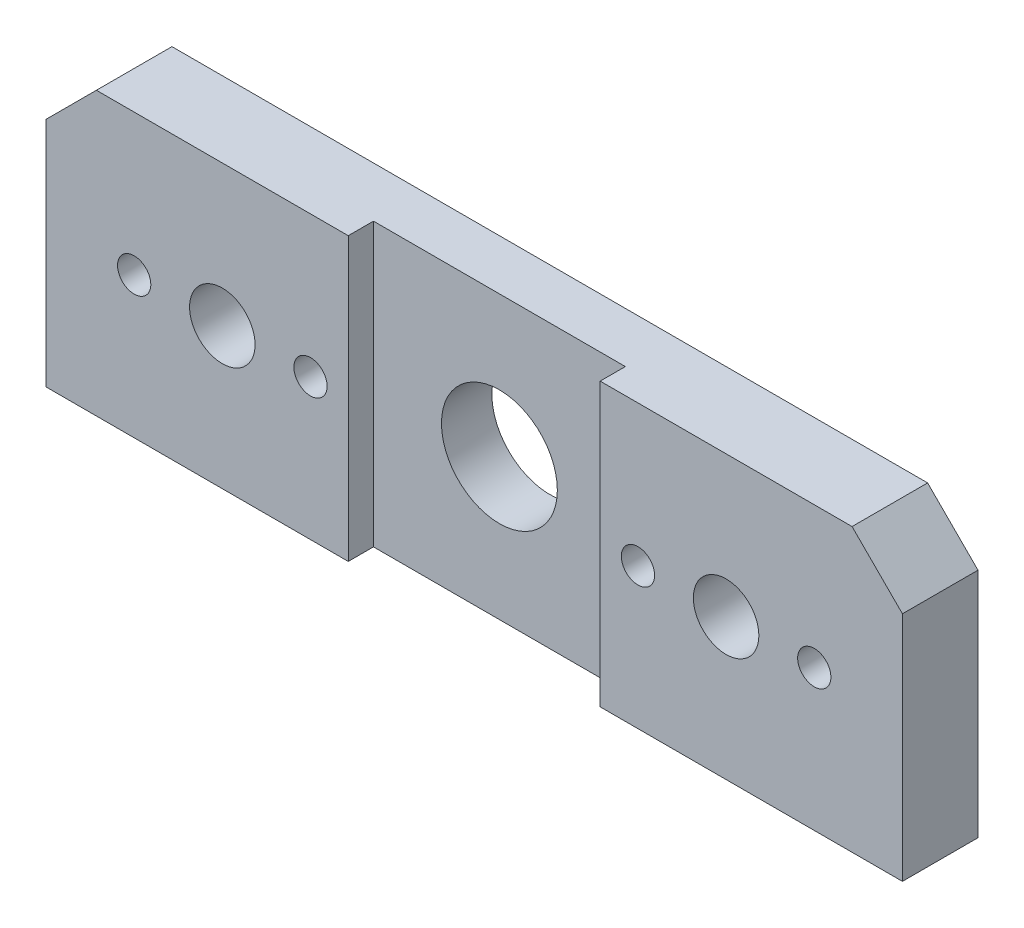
from build123d import *

# Parameters (mm, degrees)
ESQUISSE1_W                                     = 170
ESQUISSE1_H                                     = 56
EXTRUSION1_DEPTH                                = 15
CHANFREIN1_SIZE                                 = 10
ESQUISSE2_W                                     = 50
ESQUISSE2_H                                     = 84.086461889
ENL_V_MAT_EXTRU_1_DEPTH                         = 5
ESQUISSE3_R                                     = 11.5
ESQUISSE3_R_2                                   = 6.5
ENL_V_MAT_EXTRU_2_DEPTH                         = 103.888288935
CHAMBRAGE_POUR_VIS_T_TE_CYLINDRIQUE_D           = 6.6
CHAMBRAGE_POUR_VIS_T_TE_CYLINDRIQUE_CBORE_D     = 12
CHAMBRAGE_POUR_VIS_T_TE_CYLINDRIQUE_CBORE_DEPTH = 7
TROU_TARAUD_M6X1_01_D                           = 4.8
TROU_TARAUD_M6X1_01_DEPTH                       = 23
TROU_TARAUD_M6X1_01_TIP                         = 1.442065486


with BuildPart() as part:
    # Esquisse1 → Extrusion1 (new body)
    with BuildSketch(Plane.XY):
        with Locations((0, 28)):
            Rectangle(ESQUISSE1_W, ESQUISSE1_H)
    extrude(amount=EXTRUSION1_DEPTH)

    # Chanfrein1
    chanfrein1_edges = [part.edges().sort_by_distance(p)[0] for p in [
        (-85, 56, 7.5),
        (85, 56, 7.5),
    ]]
    chamfer(chanfrein1_edges, length=CHANFREIN1_SIZE)

    # Esquisse2 → Enl_v. mat.-Extru.1 (cut)
    with BuildSketch(Plane.XY.offset(15)):
        with Locations((0, 42.043230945)):
            Rectangle(ESQUISSE2_W, ESQUISSE2_H)
    extrude(amount=-ENL_V_MAT_EXTRU_1_DEPTH, mode=Mode.SUBTRACT)

    # Esquisse3 → Enl_v. mat.-Extru.2 (cut, through all)
    with BuildSketch(Plane.XY.offset(15)):
        with Locations((0, 28)):
            Circle(ESQUISSE3_R)
        with Locations((-50, 28)):
            Circle(ESQUISSE3_R_2)
        with Locations((50, 28)):
            Circle(ESQUISSE3_R_2)
    extrude(amount=-ENL_V_MAT_EXTRU_2_DEPTH, mode=Mode.SUBTRACT)

    # Chambrage pour vis _ t_te cylindrique (through all)
    with Locations(Plane(origin=(0, 0, 0), x_dir=(-1, 0, 0), z_dir=(0, 0, -1))):
        with Locations((-32.5, 28), (-67.5, 28), (32.5, 28), (67.5, 28)):
            CounterBoreHole(CHAMBRAGE_POUR_VIS_T_TE_CYLINDRIQUE_D / 2, CHAMBRAGE_POUR_VIS_T_TE_CYLINDRIQUE_CBORE_D / 2, CHAMBRAGE_POUR_VIS_T_TE_CYLINDRIQUE_CBORE_DEPTH)

    # Trou taraud_ M6x1.01
    with Locations(Plane.XZ):
        with Locations((73, 7.5), (-73, 7.5)):
            Hole(TROU_TARAUD_M6X1_01_D / 2, depth=TROU_TARAUD_M6X1_01_DEPTH)
            with Locations((0, 0, -(TROU_TARAUD_M6X1_01_DEPTH + TROU_TARAUD_M6X1_01_TIP / 2))):  # 118° drill point
                Cone(0, TROU_TARAUD_M6X1_01_D / 2, TROU_TARAUD_M6X1_01_TIP, mode=Mode.SUBTRACT)


solid = part.part
